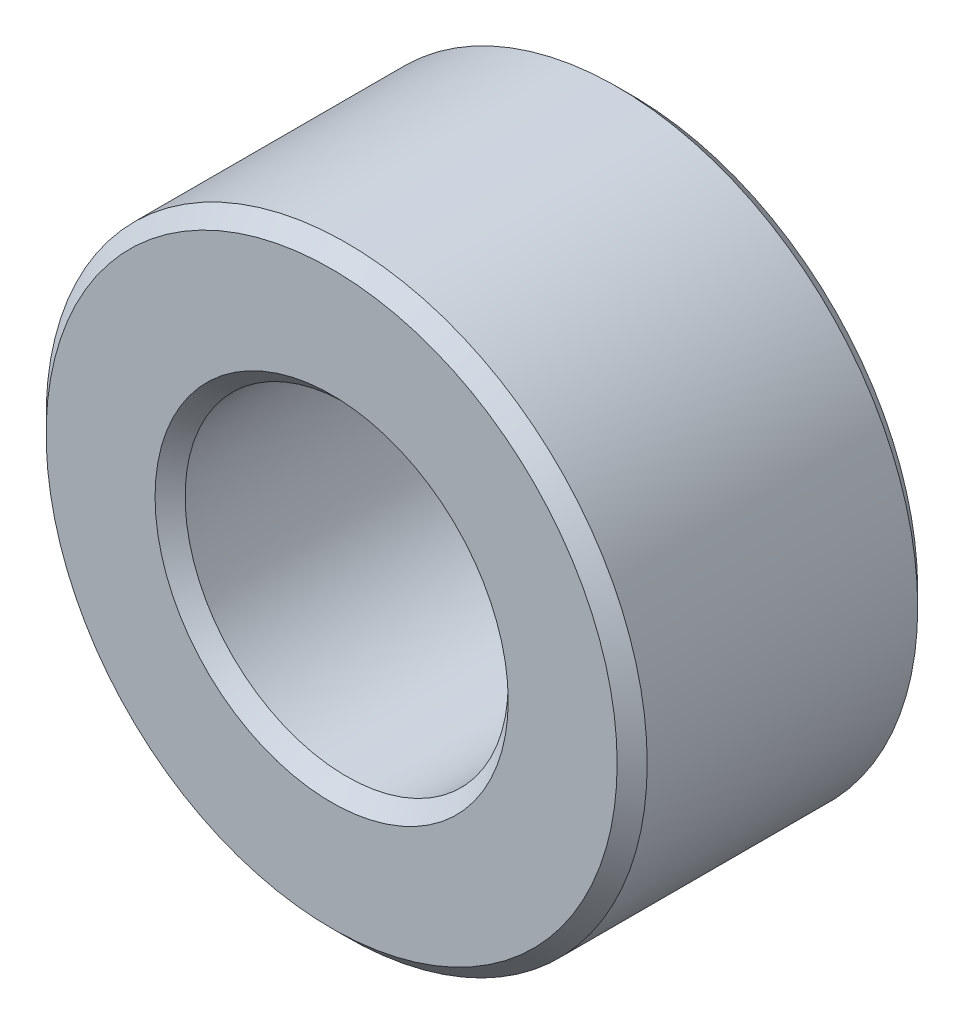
from build123d import *

# Parameters (mm, degrees)
SKETCH1_R           = 4
SKETCH1_R_2         = 2.15
BOSS_EXTRUDE2_DEPTH = 2
CHAMFER3_SIZE       = 0.2


with BuildPart() as part:
    # Sketch1 → Boss-Extrude2 (new, symmetric)
    with BuildSketch(Plane.XY):
        Circle(SKETCH1_R)
        Circle(SKETCH1_R_2, mode=Mode.SUBTRACT)
    extrude(amount=BOSS_EXTRUDE2_DEPTH, both=True)

    # Chamfer3
    chamfer3_edges = [part.edges().sort_by_distance(p)[0] for p in [
        (-4, 0, -2),
        (-4, 0, 2),
        (-2.15, 0, -2),
        (-2.15, 0, 2),
    ]]
    chamfer(chamfer3_edges, length=CHAMFER3_SIZE)


solid = part.part
